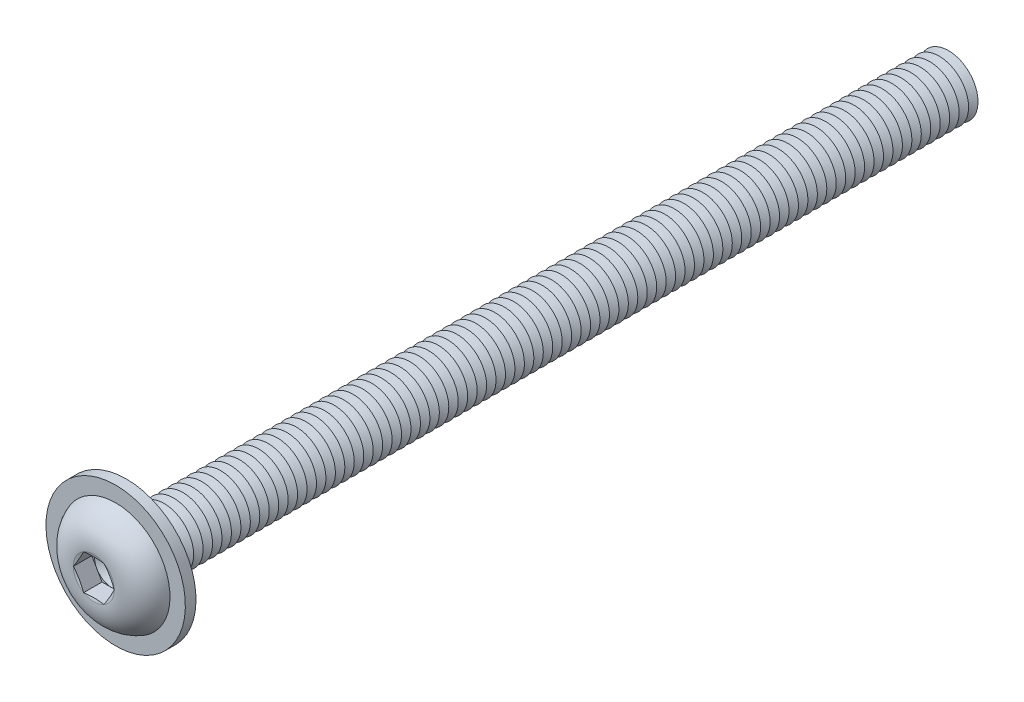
from build123d import *

# Parameters (mm, degrees)
FILLET1_R           = 0.4
LPATTERN1_COUNT     = 87
LPATTERN1_PITCH     = 0.8
CUT_EXTRUDE1_DEPTH  = 1.56
SKETCH5_R           = 5.9
SKETCH5_R_2         = 2.9
BOSS_EXTRUDE1_DEPTH = 0.9


with BuildPart() as part:
    # Sketch1 → Revolve1 (revolve)
    with BuildSketch(Plane(origin=(0, 0, 0), x_dir=(0, 0, -1), z_dir=(1, 0, 0))):
        with BuildLine():
            Line((0, 2.5), (0, 4.75))
            ThreePointArc((0, 4.75), (-2.041477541, 3.848329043), (-2.75, 1.73205))
            Line((-2.75, 1.73205), (-2.517949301, 0.866025))
            Line((-2.517949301, 0.866025), (-2.75, 0.866025))
            Line((-2.75, 0.866025), (-2.75, 0))
            Line((-2.75, 0), (70, 0))
            Line((70, 0), (70, 2.5))
            Line((70, 2.5), (0, 2.5))
        make_face()
    revolve(axis=Axis((0, 0, -70), (0, 0, 1)))

    # Fillet1
    fillet1_edges = [part.edges().sort_by_distance(p)[0] for p in [
        (0, -2.5, 0),
    ]]
    fillet(fillet1_edges, radius=FILLET1_R)

    # Sketch2 → Cut-Revolve1 (revolve, cut)
    with BuildSketch(Plane(origin=(0, 0, 0), x_dir=(0, 0, -1), z_dir=(1, 0, 0))):
        Polygon((69.6, 2.5), (70.4, 2.5), (70, 1.807179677), align=None)
    cut_revolve1 = revolve(axis=Axis((0, 0, -70), (0, 0, -1)), mode=Mode.SUBTRACT)

    # LPattern1: Cut-Revolve1 ×87
    with Locations(*[(0, 0, i * LPATTERN1_PITCH) for i in range(1, LPATTERN1_COUNT)]):
        add(cut_revolve1, mode=Mode.SUBTRACT)

    # Sketch3 → Cut-Extrude1 (cut)
    with BuildSketch(Plane.XY.offset(2.75)):
        Polygon((0.866025, 1.499999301), (-0.866025, 1.499999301), (-1.73205, 0), (-0.866025, -1.499999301), (0.866025, -1.499999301), (1.73205, 0), align=None)
    extrude(amount=-CUT_EXTRUDE1_DEPTH, mode=Mode.SUBTRACT)

    # Cut-Extrude2 cone 1 section (on through the dimple's axis) → Cut-Extrude2 (revolve, cut)
    with BuildSketch(Plane(origin=(0, 0, 1.19), x_dir=(0, -1, 0), z_dir=(1, 0, 0))):
        Polygon((0, 0), (1.499999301, 0), (0, 0.866025), align=None)
    revolve(axis=Axis((0, 0, 1.19), (0, 0, -1)), mode=Mode.SUBTRACT)

    # Sketch5 → Boss-Extrude1 (add)
    with BuildSketch(Plane(origin=(0, 0, 0), x_dir=(-1, 0, 0), z_dir=(0, 0, -1))):
        with Locations(Location((0, 0, 0), (0, 0, 90))):
            Circle(SKETCH5_R)
        Circle(SKETCH5_R_2, mode=Mode.SUBTRACT)
    extrude(amount=-BOSS_EXTRUDE1_DEPTH)


solid = part.part
